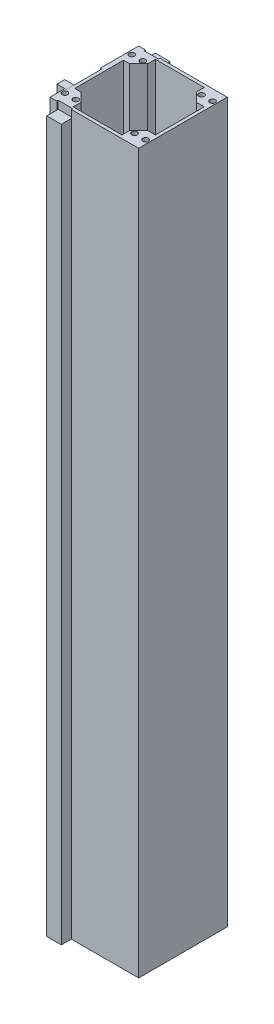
from build123d import *

# Parameters (mm, degrees)
AUFSATZ_LINEAR_AUSTRAGEN1_DEPTH   = 1825
SKIZZE2_W                         = 37
SKIZZE2_H                         = 29
AUFSATZ_LINEAR_AUSTRAGEN2_DEPTH   = 1825
AUFSATZ_LINEAR_AUSTRAGEN2_2_DEPTH = 1825
AUFSATZ_LINEAR_START              = 120
SKIZZE3_W                         = 24
SKIZZE3_H                         = 19.5
AUFSATZ_LINEAR_AUSTRAGEN3_DEPTH   = 1705
AUFSATZ_LINEAR_START_2            = 177
SKIZZE7_W                         = 36
SKIZZE7_H                         = 40
AUFSATZ_LINEAR_AUSTRAGEN6_DEPTH   = 100
SKIZZE8_R                         = 17.5
AUFSATZ_LINEAR_AUSTRAGEN7_DEPTH   = 40
SKIZZE13_W                        = 40
SKIZZE13_H                        = 140
AUFSATZ_LINEAR_AUSTRAGEN8_DEPTH   = 40
SKIZZE14_R                        = 14
AUFSATZ_LINEAR_AUSTRAGEN9_DEPTH   = 114
SKIZZE15_R                        = 14
AUFSATZ_LINEAR_AUSTRAGEN10_DEPTH  = 114
M16_GEWINDEBOHRUNG2_AT_2_COUNT    = 2
M16_GEWINDEBOHRUNG2_AT_2_PITCH    = 28
M16_GEWINDEBOHRUNG2_AT_3_COUNT    = 2
M16_GEWINDEBOHRUNG2_AT_3_PITCH    = 177
M16_GEWINDEBOHRUNG2_AT_4_COUNT    = 2
M16_GEWINDEBOHRUNG2_AT_4_PITCH    = 205
M16_GEWINDEBOHRUNG2_AT_5_COUNT    = 2
M16_GEWINDEBOHRUNG2_AT_5_PITCH    = 266.317479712
M16_GEWINDEBOHRUNG2_AT_6_COUNT    = 2
M16_GEWINDEBOHRUNG2_AT_6_PITCH    = 245.4159734
M16_GEWINDEBOHRUNG2_AT_7_COUNT    = 2
M16_GEWINDEBOHRUNG2_AT_7_PITCH    = 172.290452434
M16_GEWINDEBOHRUNG2_AT_8_COUNT    = 2
M16_GEWINDEBOHRUNG2_AT_8_PITCH    = 170
SKIZZE26_W                        = 37
SKIZZE26_H                        = 29
SCHNITT_LINEAR_AUSTRAGEN1_DEPTH   = 20


with BuildPart() as part:
    # Skizze1 → Aufsatz-Linear austragen1 (new body)
    with BuildSketch(Plane(origin=(0, 0, 0), x_dir=(1, 0, 0), z_dir=(0, 1, 0))):
        Polygon((-58.5, -112.5), (112.5, -112.5), (112.5, 112.5), (-58.5, 112.5), (-58.5, 109), (-95.5, 109), (-95.5, 112.5), (-112.5, 112.5), (-112.5, 15), (-108.5, 15), (-108.5, -75), (-112.5, -75), (-112.5, -112.5), (-95.5, -112.5), (-95.5, -109), (-58.5, -109), align=None)
        Polygon((-62, 104.5), (62, 104.5), (62, 85), (85, 62), (104.5, 62), (104.5, -62), (85, -62), (62, -85), (62, -104.5), (-62, -104.5), (-62, -85), (-85, -62), (-100.5, -62), (-100.5, 62), (-85, 62), (-62, 85), align=None, mode=Mode.SUBTRACT)
    extrude(amount=AUFSATZ_LINEAR_AUSTRAGEN1_DEPTH)

    # Skizze13 → Aufsatz-Linear austragen8 (add)
    with BuildSketch(Plane.ZY.offset(112.5)):
        with Locations((-70, 187.5)):
            Rectangle(SKIZZE13_W, SKIZZE13_H)
        with Locations((-70, 1605.5)):
            Rectangle(SKIZZE13_W, SKIZZE13_H)
    extrude(amount=AUFSATZ_LINEAR_AUSTRAGEN8_DEPTH)

    # Skizze14 → Aufsatz-Linear austragen9 (add)
    with BuildSketch(Plane(origin=(0, 257.5, 0), x_dir=(1, 0, 0), z_dir=(0, 1, 0))):
        with Locations(Location((-132.907287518, 69.906920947, 0), (0, 0, 90))):
            Circle(SKIZZE14_R)
    extrude(amount=AUFSATZ_LINEAR_AUSTRAGEN9_DEPTH)

    # Skizze15 → Aufsatz-Linear austragen10 (add)
    with BuildSketch(Plane.XZ.offset(-1535.5)):
        with Locations(Location((-133.103967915, -70.479703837, 0), (0, 0, 90))):
            Circle(SKIZZE15_R)
    extrude(amount=AUFSATZ_LINEAR_AUSTRAGEN10_DEPTH)

    # Skizze25 → M16 Gewindebohrung2 (revolve, cut)
    with BuildSketch(Plane(origin=(-102.5, 1825, -85), x_dir=(0, 0, 1), z_dir=(1, 0, 0))):
        Polygon((0, 0), (0, 46.206024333), (7, 42), (7, 0), align=None)
    m16_gewindebohrung2 = revolve(axis=Axis((-102.5, 1831.35, -85), (0, -1, 0)), mode=Mode.SUBTRACT)

    # M16 Gewindebohrung2 at 2: M16 Gewindebohrung2 ×2
    with Locations(*[(i * M16_GEWINDEBOHRUNG2_AT_2_PITCH, 0, 0) for i in range(1, M16_GEWINDEBOHRUNG2_AT_2_COUNT)]):
        add(m16_gewindebohrung2, mode=Mode.SUBTRACT)

    # M16 Gewindebohrung2 at 3: M16 Gewindebohrung2 ×2
    with Locations(*[(i * M16_GEWINDEBOHRUNG2_AT_3_PITCH, 0, 0) for i in range(1, M16_GEWINDEBOHRUNG2_AT_3_COUNT)]):
        add(m16_gewindebohrung2, mode=Mode.SUBTRACT)

    # M16 Gewindebohrung2 at 4: M16 Gewindebohrung2 ×2
    with Locations(*[(i * M16_GEWINDEBOHRUNG2_AT_4_PITCH, 0, 0) for i in range(1, M16_GEWINDEBOHRUNG2_AT_4_COUNT)]):
        add(m16_gewindebohrung2, mode=Mode.SUBTRACT)

    # M16 Gewindebohrung2 at 5: M16 Gewindebohrung2 ×2
    with Locations(*[Vector(0.7697579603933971, 0, 0.6383358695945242) * (i * M16_GEWINDEBOHRUNG2_AT_5_PITCH) for i in range(1, M16_GEWINDEBOHRUNG2_AT_5_COUNT)]):
        add(m16_gewindebohrung2, mode=Mode.SUBTRACT)

    # M16 Gewindebohrung2 at 6: M16 Gewindebohrung2 ×2
    with Locations(*[Vector(0.7212244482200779, 0, 0.6927014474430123) * (i * M16_GEWINDEBOHRUNG2_AT_6_PITCH) for i in range(1, M16_GEWINDEBOHRUNG2_AT_6_COUNT)]):
        add(m16_gewindebohrung2, mode=Mode.SUBTRACT)

    # M16 Gewindebohrung2 at 7: M16 Gewindebohrung2 ×2
    with Locations(*[Vector(0.16251626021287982, 0, 0.9867058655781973) * (i * M16_GEWINDEBOHRUNG2_AT_7_PITCH) for i in range(1, M16_GEWINDEBOHRUNG2_AT_7_COUNT)]):
        add(m16_gewindebohrung2, mode=Mode.SUBTRACT)

    # M16 Gewindebohrung2 at 8: M16 Gewindebohrung2 ×2
    with Locations(*[(0, 0, i * M16_GEWINDEBOHRUNG2_AT_8_PITCH) for i in range(1, M16_GEWINDEBOHRUNG2_AT_8_COUNT)]):
        add(m16_gewindebohrung2, mode=Mode.SUBTRACT)


with BuildPart() as body_2:
    # Skizze2 → Aufsatz-Linear austragen2 (new body)
    with BuildSketch(Plane(origin=(0, 0, 0), x_dir=(1, 0, 0), z_dir=(0, 1, 0))):
        with Locations((-77, 123.5)):
            Rectangle(SKIZZE2_W, SKIZZE2_H)
    extrude(amount=AUFSATZ_LINEAR_AUSTRAGEN2_DEPTH)


with BuildPart() as body_3:
    # Skizze2 → Aufsatz-Linear austragen2 2 (new body)
    with BuildSketch(Plane(origin=(0, 0, 0), x_dir=(1, 0, 0), z_dir=(0, 1, 0))):
        with Locations((-77, -123.5)):
            Rectangle(SKIZZE2_W, SKIZZE2_H)
    extrude(amount=AUFSATZ_LINEAR_AUSTRAGEN2_2_DEPTH)


with BuildPart() as body_4:
    # Skizze3 → Aufsatz-Linear austragen3 (new body)
    with BuildSketch(Plane(origin=(0, 0, 0), x_dir=(1, 0, 0), z_dir=(0, 1, 0)).offset(AUFSATZ_LINEAR_START)):
        with Locations((-120.5, -65.25)):
            Rectangle(SKIZZE3_W, SKIZZE3_H)
    extrude(amount=AUFSATZ_LINEAR_AUSTRAGEN3_DEPTH)


with BuildPart() as body_5:
    # Skizze7 → Aufsatz-Linear austragen6 (new body)
    with BuildSketch(Plane(origin=(0, 0, 0), x_dir=(1, 0, 0), z_dir=(0, 1, 0)).offset(AUFSATZ_LINEAR_START_2)):
        with Locations((-130.5, 85)):
            Rectangle(SKIZZE7_W, SKIZZE7_H)
    extrude(amount=AUFSATZ_LINEAR_AUSTRAGEN6_DEPTH)


with BuildPart() as body_6:
    # Skizze8 → Aufsatz-Linear austragen7 (new body)
    with BuildSketch(Plane(origin=(0, 277, 0), x_dir=(1, 0, 0), z_dir=(0, 1, 0))):
        with Locations(Location((-130.5, 85, 0), (0, 0, 270))):
            Circle(SKIZZE8_R)
    extrude(amount=AUFSATZ_LINEAR_AUSTRAGEN7_DEPTH)


with BuildPart() as schnitt_linear_austragen1_tool:
    # Skizze26 → Schnitt-Linear austragen1 (new body)
    with BuildSketch(Plane(origin=(0, 1825, 0), x_dir=(1, 0, 0), z_dir=(0, 1, 0))):
        with Locations((-77, -123.5)):
            Rectangle(SKIZZE26_W, SKIZZE26_H)
        with Locations((-77, 123.5)):
            Rectangle(SKIZZE26_W, SKIZZE26_H)
    extrude(amount=-SCHNITT_LINEAR_AUSTRAGEN1_DEPTH)


with BuildPart() as body_2_1:
    add(body_2.part)

    # Schnitt-Linear austragen1: cut by schnitt_linear_austragen1_tool
    add(schnitt_linear_austragen1_tool.part, mode=Mode.SUBTRACT)


with BuildPart() as body_3_1:
    add(body_3.part)

    # Schnitt-Linear austragen1: cut by schnitt_linear_austragen1_tool
    add(schnitt_linear_austragen1_tool.part, mode=Mode.SUBTRACT)


solid = Compound([part.part, body_4.part, body_5.part, body_6.part, body_2_1.part, body_3_1.part])
